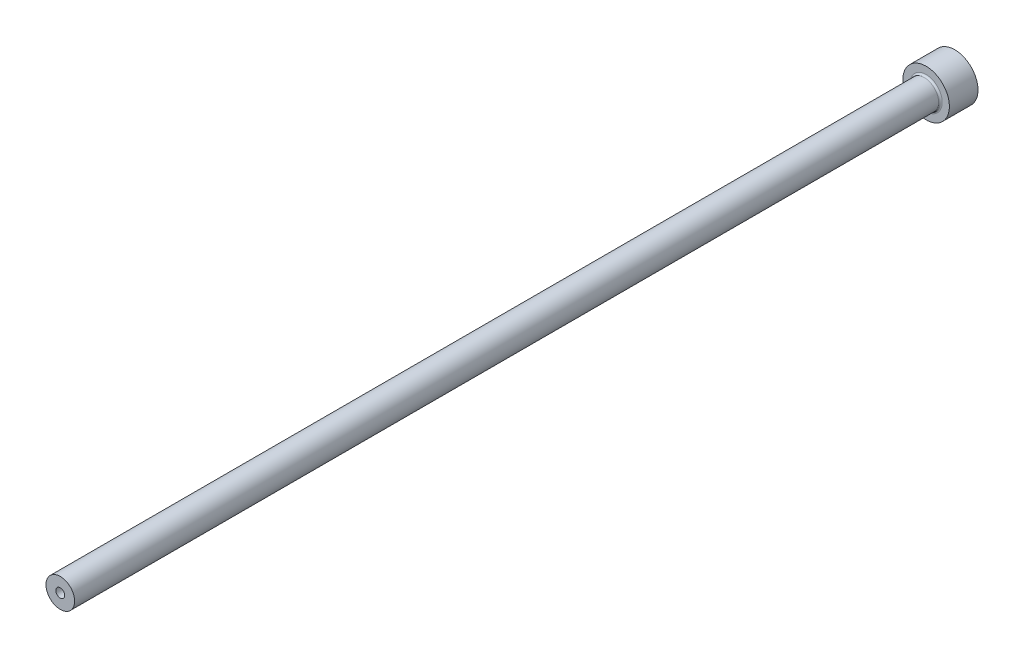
ISO-10303-21;
HEADER;
FILE_DESCRIPTION(('STEP AP214'),'2;1');
FILE_NAME('part.step','',(''),(''),'','','');
FILE_SCHEMA(('AUTOMOTIVE_DESIGN { 1 0 10303 214 1 1 1 1 }'));
ENDSEC;
DATA;
#1=APPLICATION_CONTEXT('core data for automotive mechanical design processes');
#2=APPLICATION_PROTOCOL_DEFINITION('international standard','automotive_design',2000,#1);
#3=PRODUCT_CONTEXT('',#1,'mechanical');
#4=PRODUCT('Part','Part','',(#3));
#5=PRODUCT_RELATED_PRODUCT_CATEGORY('part','',(#4));
#6=PRODUCT_DEFINITION_FORMATION('','',#4);
#7=PRODUCT_DEFINITION_CONTEXT('part definition',#1,'design');
#8=PRODUCT_DEFINITION('design','',#6,#7);
#9=PRODUCT_DEFINITION_SHAPE('','',#8);
#10=(LENGTH_UNIT() NAMED_UNIT(*) SI_UNIT(.MILLI.,.METRE.));
#11=(NAMED_UNIT(*) PLANE_ANGLE_UNIT() SI_UNIT($,.RADIAN.));
#12=(NAMED_UNIT(*) SI_UNIT($,.STERADIAN.) SOLID_ANGLE_UNIT());
#13=UNCERTAINTY_MEASURE_WITH_UNIT(LENGTH_MEASURE(1.E-05),#10,'distance_accuracy_value','');
#14=(GEOMETRIC_REPRESENTATION_CONTEXT(3) GLOBAL_UNCERTAINTY_ASSIGNED_CONTEXT((#13)) GLOBAL_UNIT_ASSIGNED_CONTEXT((#10,
#11,#12)) REPRESENTATION_CONTEXT('',''));
#15=CARTESIAN_POINT('',(0.,0.,0.));
#16=DIRECTION('',(0.,0.,1.));
#17=DIRECTION('',(1.,0.,0.));
#18=AXIS2_PLACEMENT_3D('',#15,#16,#17);
#19=CARTESIAN_POINT('',(0.,0.,250.));
#20=DIRECTION('',(0.,0.,-1.));
#21=DIRECTION('',(-1.,0.,0.));
#22=AXIS2_PLACEMENT_3D('',#19,#20,#21);
#23=PLANE('',#22);
#24=CARTESIAN_POINT('',(0.,0.,250.));
#25=DIRECTION('',(0.,0.,1.));
#26=DIRECTION('',(1.,0.,0.));
#27=AXIS2_PLACEMENT_3D('',#24,#25,#26);
#28=CIRCLE('',#27,1.24999999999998);
#29=CARTESIAN_POINT('',(1.24999999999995,0.,250.));
#30=VERTEX_POINT('',#29);
#31=EDGE_CURVE('E63',#30,#30,#28,.T.);
#32=ORIENTED_EDGE('',*,*,#31,.F.);
#33=EDGE_LOOP('',(#32));
#34=FACE_BOUND('',#33,.T.);
#35=CARTESIAN_POINT('',(0.,0.,250.));
#36=DIRECTION('',(0.,0.,1.));
#37=DIRECTION('',(1.,0.,0.));
#38=AXIS2_PLACEMENT_3D('',#35,#36,#37);
#39=CIRCLE('',#38,3.99999999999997);
#40=CARTESIAN_POINT('',(3.99999999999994,0.,250.));
#41=VERTEX_POINT('',#40);
#42=EDGE_CURVE('E54',#41,#41,#39,.T.);
#43=ORIENTED_EDGE('',*,*,#42,.T.);
#44=EDGE_LOOP('',(#43));
#45=FACE_BOUND('',#44,.T.);
#46=ADVANCED_FACE('F34',(#34,#45),#23,.F.);
#47=CARTESIAN_POINT('',(0.,0.,250.));
#48=DIRECTION('',(0.,0.,1.));
#49=DIRECTION('',(1.,0.,0.));
#50=AXIS2_PLACEMENT_3D('',#47,#48,#49);
#51=CYLINDRICAL_SURFACE('',#50,3.99999999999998);
#52=CARTESIAN_POINT('',(0.,0.,8.50000000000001));
#53=DIRECTION('',(0.,0.,1.));
#54=DIRECTION('',(1.,0.,0.));
#55=AXIS2_PLACEMENT_3D('',#52,#53,#54);
#56=CIRCLE('',#55,3.99999999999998);
#57=CARTESIAN_POINT('',(3.99999999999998,0.,8.50000000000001));
#58=VERTEX_POINT('',#57);
#59=EDGE_CURVE('E49',#58,#58,#56,.T.);
#60=ORIENTED_EDGE('',*,*,#59,.T.);
#61=EDGE_LOOP('',(#60));
#62=FACE_BOUND('',#61,.T.);
#63=ORIENTED_EDGE('',*,*,#42,.F.);
#64=EDGE_LOOP('',(#63));
#65=FACE_BOUND('',#64,.T.);
#66=ADVANCED_FACE('F92',(#62,#65),#51,.T.);
#67=CARTESIAN_POINT('',(0.,0.,8.));
#68=DIRECTION('',(0.,0.,1.));
#69=DIRECTION('',(1.,0.,0.));
#70=AXIS2_PLACEMENT_3D('',#67,#68,#69);
#71=PLANE('',#70);
#72=CARTESIAN_POINT('',(0.,0.,8.));
#73=DIRECTION('',(0.,0.,1.));
#74=DIRECTION('',(1.,0.,0.));
#75=AXIS2_PLACEMENT_3D('',#72,#73,#74);
#76=CIRCLE('',#75,4.49999999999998);
#77=CARTESIAN_POINT('',(4.49999999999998,0.,8.));
#78=VERTEX_POINT('',#77);
#79=EDGE_CURVE('E45',#78,#78,#76,.F.);
#80=ORIENTED_EDGE('',*,*,#79,.T.);
#81=EDGE_LOOP('',(#80));
#82=FACE_BOUND('',#81,.T.);
#83=CARTESIAN_POINT('',(0.,0.,8.00000000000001));
#84=DIRECTION('',(0.,0.,1.));
#85=DIRECTION('',(1.,0.,0.));
#86=AXIS2_PLACEMENT_3D('',#83,#84,#85);
#87=CIRCLE('',#86,6.5);
#88=CARTESIAN_POINT('',(6.49999999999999,0.,8.00000000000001));
#89=VERTEX_POINT('',#88);
#90=EDGE_CURVE('E57',#89,#89,#87,.T.);
#91=ORIENTED_EDGE('',*,*,#90,.T.);
#92=EDGE_LOOP('',(#91));
#93=FACE_BOUND('',#92,.T.);
#94=ADVANCED_FACE('F98',(#82,#93),#71,.T.);
#95=CARTESIAN_POINT('',(0.,0.,250.));
#96=DIRECTION('',(0.,0.,1.));
#97=DIRECTION('',(1.,0.,0.));
#98=AXIS2_PLACEMENT_3D('',#95,#96,#97);
#99=CYLINDRICAL_SURFACE('',#98,6.5);
#100=ORIENTED_EDGE('',*,*,#90,.F.);
#101=EDGE_LOOP('',(#100));
#102=FACE_BOUND('',#101,.T.);
#103=CARTESIAN_POINT('',(0.,0.,0.));
#104=DIRECTION('',(0.,0.,1.));
#105=DIRECTION('',(1.,0.,0.));
#106=AXIS2_PLACEMENT_3D('',#103,#104,#105);
#107=CIRCLE('',#106,6.49999999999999);
#108=CARTESIAN_POINT('',(6.49999999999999,0.,0.));
#109=VERTEX_POINT('',#108);
#110=EDGE_CURVE('E60',#109,#109,#107,.T.);
#111=ORIENTED_EDGE('',*,*,#110,.T.);
#112=EDGE_LOOP('',(#111));
#113=FACE_BOUND('',#112,.T.);
#114=ADVANCED_FACE('F89',(#102,#113),#99,.T.);
#115=CARTESIAN_POINT('',(0.,0.,0.));
#116=DIRECTION('',(0.,0.,1.));
#117=DIRECTION('',(1.,0.,0.));
#118=AXIS2_PLACEMENT_3D('',#115,#116,#117);
#119=PLANE('',#118);
#120=CARTESIAN_POINT('',(0.,0.,0.));
#121=DIRECTION('',(0.,0.,1.));
#122=DIRECTION('',(1.,0.,0.));
#123=AXIS2_PLACEMENT_3D('',#120,#121,#122);
#124=CIRCLE('',#123,1.99999999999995);
#125=CARTESIAN_POINT('',(1.99999999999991,0.,0.));
#126=VERTEX_POINT('',#125);
#127=EDGE_CURVE('E41',#126,#126,#124,.T.);
#128=ORIENTED_EDGE('',*,*,#127,.T.);
#129=EDGE_LOOP('',(#128));
#130=FACE_BOUND('',#129,.T.);
#131=ORIENTED_EDGE('',*,*,#110,.F.);
#132=EDGE_LOOP('',(#131));
#133=FACE_BOUND('',#132,.T.);
#134=ADVANCED_FACE('F83',(#130,#133),#119,.F.);
#135=CARTESIAN_POINT('',(0.,0.,250.));
#136=DIRECTION('',(0.,0.,1.));
#137=DIRECTION('',(1.,0.,0.));
#138=AXIS2_PLACEMENT_3D('',#135,#136,#137);
#139=CYLINDRICAL_SURFACE('',#138,1.25);
#140=ORIENTED_EDGE('',*,*,#31,.T.);
#141=EDGE_LOOP('',(#140));
#142=FACE_BOUND('',#141,.T.);
#143=CARTESIAN_POINT('',(0.,0.,150.));
#144=DIRECTION('',(0.,0.,1.));
#145=DIRECTION('',(1.,0.,0.));
#146=AXIS2_PLACEMENT_3D('',#143,#144,#145);
#147=CIRCLE('',#146,1.25000000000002);
#148=CARTESIAN_POINT('',(1.24999999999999,0.,150.));
#149=VERTEX_POINT('',#148);
#150=EDGE_CURVE('E66',#149,#149,#147,.T.);
#151=ORIENTED_EDGE('',*,*,#150,.F.);
#152=EDGE_LOOP('',(#151));
#153=FACE_BOUND('',#152,.T.);
#154=ADVANCED_FACE('F78',(#142,#153),#139,.F.);
#155=CARTESIAN_POINT('',(0.,0.,150.));
#156=DIRECTION('',(0.,0.,-1.));
#157=DIRECTION('',(-1.,0.,0.));
#158=AXIS2_PLACEMENT_3D('',#155,#156,#157);
#159=CONICAL_SURFACE('',#158,1.25000000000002,0.523598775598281);
#160=CARTESIAN_POINT('',(0.,0.,149.566987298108));
#161=DIRECTION('',(0.,0.,1.));
#162=DIRECTION('',(1.,0.,0.));
#163=AXIS2_PLACEMENT_3D('',#160,#161,#162);
#164=CIRCLE('',#163,1.49999999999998);
#165=CARTESIAN_POINT('',(1.49999999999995,0.,149.566987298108));
#166=VERTEX_POINT('',#165);
#167=EDGE_CURVE('E69',#166,#166,#164,.T.);
#168=ORIENTED_EDGE('',*,*,#167,.F.);
#169=EDGE_LOOP('',(#168));
#170=FACE_BOUND('',#169,.T.);
#171=ORIENTED_EDGE('',*,*,#150,.T.);
#172=EDGE_LOOP('',(#171));
#173=FACE_BOUND('',#172,.T.);
#174=ADVANCED_FACE('F75',(#170,#173),#159,.F.);
#175=CARTESIAN_POINT('',(0.,0.,250.));
#176=DIRECTION('',(0.,0.,1.));
#177=DIRECTION('',(1.,0.,0.));
#178=AXIS2_PLACEMENT_3D('',#175,#176,#177);
#179=CYLINDRICAL_SURFACE('',#178,1.49999999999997);
#180=CARTESIAN_POINT('',(0.,0.,0.499999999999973));
#181=DIRECTION('',(0.,0.,1.));
#182=DIRECTION('',(1.,0.,0.));
#183=AXIS2_PLACEMENT_3D('',#180,#181,#182);
#184=CIRCLE('',#183,1.49999999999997);
#185=CARTESIAN_POINT('',(1.49999999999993,0.,0.499999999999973));
#186=VERTEX_POINT('',#185);
#187=EDGE_CURVE('E10',#186,#186,#184,.F.);
#188=ORIENTED_EDGE('',*,*,#187,.T.);
#189=EDGE_LOOP('',(#188));
#190=FACE_BOUND('',#189,.T.);
#191=ORIENTED_EDGE('',*,*,#167,.T.);
#192=EDGE_LOOP('',(#191));
#193=FACE_BOUND('',#192,.T.);
#194=ADVANCED_FACE('F73',(#190,#193),#179,.F.);
#195=CARTESIAN_POINT('',(0.,0.,8.50000000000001));
#196=DIRECTION('',(0.,0.,1.));
#197=DIRECTION('',(1.,0.,0.));
#198=AXIS2_PLACEMENT_3D('',#195,#196,#197);
#199=TOROIDAL_SURFACE('',#198,4.49999999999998,0.5);
#200=ORIENTED_EDGE('',*,*,#79,.F.);
#201=EDGE_LOOP('',(#200));
#202=FACE_BOUND('',#201,.T.);
#203=ORIENTED_EDGE('',*,*,#59,.F.);
#204=EDGE_LOOP('',(#203));
#205=FACE_BOUND('',#204,.T.);
#206=ADVANCED_FACE('F104',(#202,#205),#199,.F.);
#207=CARTESIAN_POINT('',(0.,0.,0.));
#208=DIRECTION('',(0.,0.,-1.));
#209=DIRECTION('',(-1.,0.,0.));
#210=AXIS2_PLACEMENT_3D('',#207,#208,#209);
#211=CONICAL_SURFACE('',#210,1.99999999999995,0.785398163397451);
#212=ORIENTED_EDGE('',*,*,#187,.F.);
#213=EDGE_LOOP('',(#212));
#214=FACE_BOUND('',#213,.T.);
#215=ORIENTED_EDGE('',*,*,#127,.F.);
#216=EDGE_LOOP('',(#215));
#217=FACE_BOUND('',#216,.T.);
#218=ADVANCED_FACE('F36',(#214,#217),#211,.F.);
#219=CLOSED_SHELL('',(#46,#66,#94,#114,#134,#154,#174,#194,#206,#218));
#220=MANIFOLD_SOLID_BREP('B2',#219);
#221=ADVANCED_BREP_SHAPE_REPRESENTATION('',(#18,#220),#14);
#222=SHAPE_DEFINITION_REPRESENTATION(#9,#221);
ENDSEC;
END-ISO-10303-21;
